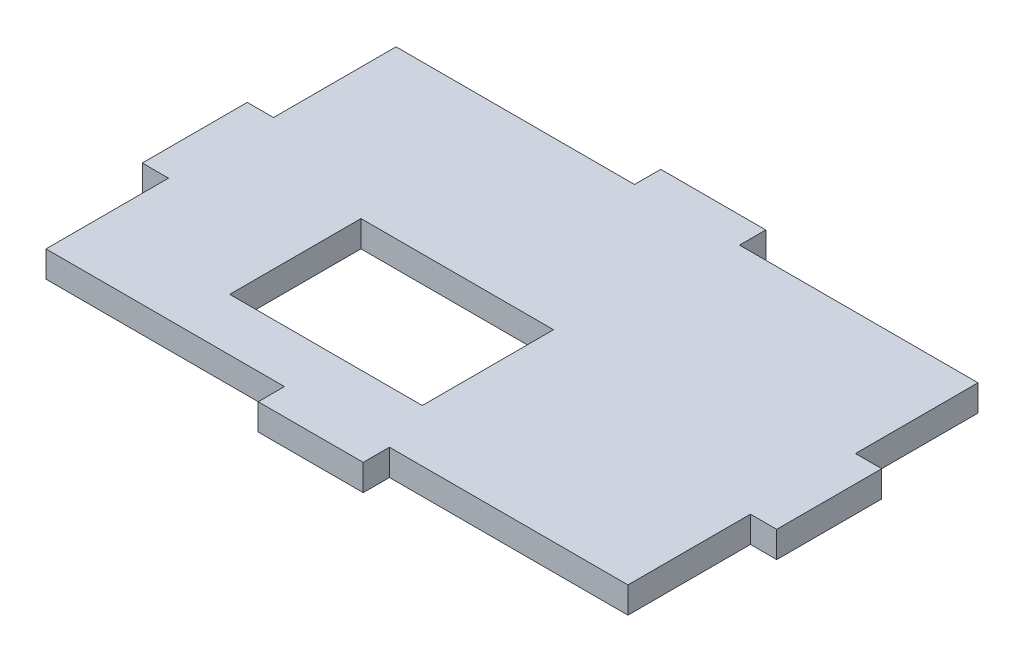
ISO-10303-21;
HEADER;
FILE_DESCRIPTION(('STEP AP214'),'2;1');
FILE_NAME('part.step','',(''),(''),'','','');
FILE_SCHEMA(('AUTOMOTIVE_DESIGN { 1 0 10303 214 1 1 1 1 }'));
ENDSEC;
DATA;
#1=APPLICATION_CONTEXT('core data for automotive mechanical design processes');
#2=APPLICATION_PROTOCOL_DEFINITION('international standard','automotive_design',2000,#1);
#3=PRODUCT_CONTEXT('',#1,'mechanical');
#4=PRODUCT('Part','Part','',(#3));
#5=PRODUCT_RELATED_PRODUCT_CATEGORY('part','',(#4));
#6=PRODUCT_DEFINITION_FORMATION('','',#4);
#7=PRODUCT_DEFINITION_CONTEXT('part definition',#1,'design');
#8=PRODUCT_DEFINITION('design','',#6,#7);
#9=PRODUCT_DEFINITION_SHAPE('','',#8);
#10=(LENGTH_UNIT() NAMED_UNIT(*) SI_UNIT(.MILLI.,.METRE.));
#11=(NAMED_UNIT(*) PLANE_ANGLE_UNIT() SI_UNIT($,.RADIAN.));
#12=(NAMED_UNIT(*) SI_UNIT($,.STERADIAN.) SOLID_ANGLE_UNIT());
#13=UNCERTAINTY_MEASURE_WITH_UNIT(LENGTH_MEASURE(1.E-05),#10,'distance_accuracy_value','');
#14=(GEOMETRIC_REPRESENTATION_CONTEXT(3) GLOBAL_UNCERTAINTY_ASSIGNED_CONTEXT((#13)) GLOBAL_UNIT_ASSIGNED_CONTEXT((#10,
#11,#12)) REPRESENTATION_CONTEXT('',''));
#15=CARTESIAN_POINT('',(0.,0.,0.));
#16=DIRECTION('',(0.,0.,1.));
#17=DIRECTION('',(1.,0.,0.));
#18=AXIS2_PLACEMENT_3D('',#15,#16,#17);
#19=CARTESIAN_POINT('',(66.5,3.,0.));
#20=DIRECTION('',(1.,0.,0.));
#21=DIRECTION('',(0.,0.,-1.));
#22=AXIS2_PLACEMENT_3D('',#19,#20,#21);
#23=PLANE('',#22);
#24=DIRECTION('',(0.,0.,1.));
#25=VECTOR('',#24,1.);
#26=CARTESIAN_POINT('',(66.5,0.,0.));
#27=LINE('',#26,#25);
#28=CARTESIAN_POINT('',(66.5,0.,0.));
#29=VERTEX_POINT('',#28);
#30=CARTESIAN_POINT('',(66.5,0.,14.));
#31=VERTEX_POINT('',#30);
#32=EDGE_CURVE('E242',#29,#31,#27,.T.);
#33=ORIENTED_EDGE('',*,*,#32,.F.);
#34=DIRECTION('',(0.,-1.,0.));
#35=VECTOR('',#34,1.);
#36=CARTESIAN_POINT('',(66.5,3.,0.));
#37=LINE('',#36,#35);
#38=CARTESIAN_POINT('',(66.5,3.,0.));
#39=VERTEX_POINT('',#38);
#40=EDGE_CURVE('E12',#39,#29,#37,.T.);
#41=ORIENTED_EDGE('',*,*,#40,.F.);
#42=DIRECTION('',(0.,0.,1.));
#43=VECTOR('',#42,1.);
#44=CARTESIAN_POINT('',(66.5,3.,0.));
#45=LINE('',#44,#43);
#46=CARTESIAN_POINT('',(66.5,3.,14.));
#47=VERTEX_POINT('',#46);
#48=EDGE_CURVE('E246',#39,#47,#45,.T.);
#49=ORIENTED_EDGE('',*,*,#48,.T.);
#50=DIRECTION('',(0.,-1.,0.));
#51=VECTOR('',#50,1.);
#52=CARTESIAN_POINT('',(66.5,3.,14.));
#53=LINE('',#52,#51);
#54=EDGE_CURVE('E282',#47,#31,#53,.T.);
#55=ORIENTED_EDGE('',*,*,#54,.T.);
#56=EDGE_LOOP('',(#33,#41,#49,#55));
#57=FACE_BOUND('',#56,.T.);
#58=ADVANCED_FACE('F40',(#57),#23,.T.);
#59=CARTESIAN_POINT('',(0.,3.,0.));
#60=DIRECTION('',(0.,0.,-1.));
#61=DIRECTION('',(-1.,0.,0.));
#62=AXIS2_PLACEMENT_3D('',#59,#60,#61);
#63=PLANE('',#62);
#64=DIRECTION('',(1.,0.,0.));
#65=VECTOR('',#64,1.);
#66=CARTESIAN_POINT('',(0.,0.,0.));
#67=LINE('',#66,#65);
#68=CARTESIAN_POINT('',(39.25,0.,0.));
#69=VERTEX_POINT('',#68);
#70=EDGE_CURVE('E285',#69,#29,#67,.T.);
#71=ORIENTED_EDGE('',*,*,#70,.F.);
#72=DIRECTION('',(0.,-1.,0.));
#73=VECTOR('',#72,1.);
#74=CARTESIAN_POINT('',(39.25,3.,0.));
#75=LINE('',#74,#73);
#76=CARTESIAN_POINT('',(39.25,3.,0.));
#77=VERTEX_POINT('',#76);
#78=EDGE_CURVE('E48',#77,#69,#75,.T.);
#79=ORIENTED_EDGE('',*,*,#78,.F.);
#80=DIRECTION('',(1.,0.,0.));
#81=VECTOR('',#80,1.);
#82=CARTESIAN_POINT('',(0.,3.,0.));
#83=LINE('',#82,#81);
#84=EDGE_CURVE('E251',#77,#39,#83,.T.);
#85=ORIENTED_EDGE('',*,*,#84,.T.);
#86=ORIENTED_EDGE('',*,*,#40,.T.);
#87=EDGE_LOOP('',(#71,#79,#85,#86));
#88=FACE_BOUND('',#87,.T.);
#89=ADVANCED_FACE('F378',(#88),#63,.T.);
#90=CARTESIAN_POINT('',(39.25,3.,0.));
#91=DIRECTION('',(-1.,0.,0.));
#92=DIRECTION('',(0.,0.,1.));
#93=AXIS2_PLACEMENT_3D('',#90,#91,#92);
#94=PLANE('',#93);
#95=DIRECTION('',(0.,0.,-1.));
#96=VECTOR('',#95,1.);
#97=CARTESIAN_POINT('',(39.25,0.,0.));
#98=LINE('',#97,#96);
#99=CARTESIAN_POINT('',(39.25,0.,-3.));
#100=VERTEX_POINT('',#99);
#101=EDGE_CURVE('E289',#69,#100,#98,.T.);
#102=ORIENTED_EDGE('',*,*,#101,.T.);
#103=DIRECTION('',(0.,-1.,0.));
#104=VECTOR('',#103,1.);
#105=CARTESIAN_POINT('',(39.25,3.,-3.));
#106=LINE('',#105,#104);
#107=CARTESIAN_POINT('',(39.25,3.,-3.));
#108=VERTEX_POINT('',#107);
#109=EDGE_CURVE('E367',#108,#100,#106,.T.);
#110=ORIENTED_EDGE('',*,*,#109,.F.);
#111=DIRECTION('',(0.,0.,-1.));
#112=VECTOR('',#111,1.);
#113=CARTESIAN_POINT('',(39.25,3.,0.));
#114=LINE('',#113,#112);
#115=EDGE_CURVE('E372',#77,#108,#114,.T.);
#116=ORIENTED_EDGE('',*,*,#115,.F.);
#117=ORIENTED_EDGE('',*,*,#78,.T.);
#118=EDGE_LOOP('',(#102,#110,#116,#117));
#119=FACE_BOUND('',#118,.T.);
#120=ADVANCED_FACE('F42',(#119),#94,.F.);
#121=CARTESIAN_POINT('',(0.,3.,-3.));
#122=DIRECTION('',(0.,0.,-1.));
#123=DIRECTION('',(-1.,0.,0.));
#124=AXIS2_PLACEMENT_3D('',#121,#122,#123);
#125=PLANE('',#124);
#126=DIRECTION('',(1.,0.,0.));
#127=VECTOR('',#126,1.);
#128=CARTESIAN_POINT('',(0.,0.,-3.));
#129=LINE('',#128,#127);
#130=CARTESIAN_POINT('',(27.25,0.,-3.));
#131=VERTEX_POINT('',#130);
#132=EDGE_CURVE('E293',#131,#100,#129,.T.);
#133=ORIENTED_EDGE('',*,*,#132,.F.);
#134=DIRECTION('',(0.,-1.,0.));
#135=VECTOR('',#134,1.);
#136=CARTESIAN_POINT('',(27.25,3.,-3.));
#137=LINE('',#136,#135);
#138=CARTESIAN_POINT('',(27.25,3.,-3.));
#139=VERTEX_POINT('',#138);
#140=EDGE_CURVE('E365',#139,#131,#137,.T.);
#141=ORIENTED_EDGE('',*,*,#140,.F.);
#142=DIRECTION('',(1.,0.,0.));
#143=VECTOR('',#142,1.);
#144=CARTESIAN_POINT('',(0.,3.,-3.));
#145=LINE('',#144,#143);
#146=EDGE_CURVE('E473',#139,#108,#145,.T.);
#147=ORIENTED_EDGE('',*,*,#146,.T.);
#148=ORIENTED_EDGE('',*,*,#109,.T.);
#149=EDGE_LOOP('',(#133,#141,#147,#148));
#150=FACE_BOUND('',#149,.T.);
#151=ADVANCED_FACE('F472',(#150),#125,.T.);
#152=CARTESIAN_POINT('',(27.25,3.,0.));
#153=DIRECTION('',(-1.,0.,0.));
#154=DIRECTION('',(0.,0.,1.));
#155=AXIS2_PLACEMENT_3D('',#152,#153,#154);
#156=PLANE('',#155);
#157=DIRECTION('',(0.,0.,-1.));
#158=VECTOR('',#157,1.);
#159=CARTESIAN_POINT('',(27.25,0.,0.));
#160=LINE('',#159,#158);
#161=CARTESIAN_POINT('',(27.25,0.,0.));
#162=VERTEX_POINT('',#161);
#163=EDGE_CURVE('E296',#162,#131,#160,.T.);
#164=ORIENTED_EDGE('',*,*,#163,.F.);
#165=DIRECTION('',(0.,-1.,0.));
#166=VECTOR('',#165,1.);
#167=CARTESIAN_POINT('',(27.25,3.,0.));
#168=LINE('',#167,#166);
#169=CARTESIAN_POINT('',(27.25,3.,0.));
#170=VERTEX_POINT('',#169);
#171=EDGE_CURVE('E363',#170,#162,#168,.T.);
#172=ORIENTED_EDGE('',*,*,#171,.F.);
#173=DIRECTION('',(0.,0.,-1.));
#174=VECTOR('',#173,1.);
#175=CARTESIAN_POINT('',(27.25,3.,0.));
#176=LINE('',#175,#174);
#177=EDGE_CURVE('E468',#170,#139,#176,.T.);
#178=ORIENTED_EDGE('',*,*,#177,.T.);
#179=ORIENTED_EDGE('',*,*,#140,.T.);
#180=EDGE_LOOP('',(#164,#172,#178,#179));
#181=FACE_BOUND('',#180,.T.);
#182=ADVANCED_FACE('F465',(#181),#156,.T.);
#183=CARTESIAN_POINT('',(0.,0.,0.));
#184=VERTEX_POINT('',#183);
#185=EDGE_CURVE('E290',#184,#162,#67,.T.);
#186=ORIENTED_EDGE('',*,*,#185,.F.);
#187=DIRECTION('',(0.,-1.,0.));
#188=VECTOR('',#187,1.);
#189=CARTESIAN_POINT('',(0.,3.,0.));
#190=LINE('',#189,#188);
#191=CARTESIAN_POINT('',(0.,3.,0.));
#192=VERTEX_POINT('',#191);
#193=EDGE_CURVE('E361',#192,#184,#190,.T.);
#194=ORIENTED_EDGE('',*,*,#193,.F.);
#195=EDGE_CURVE('E462',#192,#170,#83,.T.);
#196=ORIENTED_EDGE('',*,*,#195,.T.);
#197=ORIENTED_EDGE('',*,*,#171,.T.);
#198=EDGE_LOOP('',(#186,#194,#196,#197));
#199=FACE_BOUND('',#198,.T.);
#200=ADVANCED_FACE('F461',(#199),#63,.T.);
#201=CARTESIAN_POINT('',(0.,3.,0.));
#202=DIRECTION('',(1.,0.,0.));
#203=DIRECTION('',(0.,0.,-1.));
#204=AXIS2_PLACEMENT_3D('',#201,#202,#203);
#205=PLANE('',#204);
#206=DIRECTION('',(0.,0.,1.));
#207=VECTOR('',#206,1.);
#208=CARTESIAN_POINT('',(0.,0.,0.));
#209=LINE('',#208,#207);
#210=CARTESIAN_POINT('',(0.,0.,14.));
#211=VERTEX_POINT('',#210);
#212=EDGE_CURVE('E299',#184,#211,#209,.T.);
#213=ORIENTED_EDGE('',*,*,#212,.T.);
#214=DIRECTION('',(0.,-1.,0.));
#215=VECTOR('',#214,1.);
#216=CARTESIAN_POINT('',(0.,3.,14.));
#217=LINE('',#216,#215);
#218=CARTESIAN_POINT('',(0.,3.,14.));
#219=VERTEX_POINT('',#218);
#220=EDGE_CURVE('E358',#219,#211,#217,.T.);
#221=ORIENTED_EDGE('',*,*,#220,.F.);
#222=DIRECTION('',(0.,0.,1.));
#223=VECTOR('',#222,1.);
#224=CARTESIAN_POINT('',(0.,3.,0.));
#225=LINE('',#224,#223);
#226=EDGE_CURVE('E457',#192,#219,#225,.T.);
#227=ORIENTED_EDGE('',*,*,#226,.F.);
#228=ORIENTED_EDGE('',*,*,#193,.T.);
#229=EDGE_LOOP('',(#213,#221,#227,#228));
#230=FACE_BOUND('',#229,.T.);
#231=ADVANCED_FACE('F456',(#230),#205,.F.);
#232=CARTESIAN_POINT('',(0.,3.,14.));
#233=DIRECTION('',(0.,0.,1.));
#234=DIRECTION('',(1.,0.,0.));
#235=AXIS2_PLACEMENT_3D('',#232,#233,#234);
#236=PLANE('',#235);
#237=DIRECTION('',(-1.,0.,0.));
#238=VECTOR('',#237,1.);
#239=CARTESIAN_POINT('',(0.,0.,14.));
#240=LINE('',#239,#238);
#241=CARTESIAN_POINT('',(-3.,0.,14.));
#242=VERTEX_POINT('',#241);
#243=EDGE_CURVE('E301',#211,#242,#240,.T.);
#244=ORIENTED_EDGE('',*,*,#243,.T.);
#245=DIRECTION('',(0.,-1.,0.));
#246=VECTOR('',#245,1.);
#247=CARTESIAN_POINT('',(-3.,3.,14.));
#248=LINE('',#247,#246);
#249=CARTESIAN_POINT('',(-3.,3.,14.));
#250=VERTEX_POINT('',#249);
#251=EDGE_CURVE('E355',#250,#242,#248,.T.);
#252=ORIENTED_EDGE('',*,*,#251,.F.);
#253=DIRECTION('',(-1.,0.,0.));
#254=VECTOR('',#253,1.);
#255=CARTESIAN_POINT('',(0.,3.,14.));
#256=LINE('',#255,#254);
#257=EDGE_CURVE('E453',#219,#250,#256,.T.);
#258=ORIENTED_EDGE('',*,*,#257,.F.);
#259=ORIENTED_EDGE('',*,*,#220,.T.);
#260=EDGE_LOOP('',(#244,#252,#258,#259));
#261=FACE_BOUND('',#260,.T.);
#262=ADVANCED_FACE('F450',(#261),#236,.F.);
#263=CARTESIAN_POINT('',(-3.,3.,0.));
#264=DIRECTION('',(1.,0.,0.));
#265=DIRECTION('',(0.,0.,-1.));
#266=AXIS2_PLACEMENT_3D('',#263,#264,#265);
#267=PLANE('',#266);
#268=DIRECTION('',(0.,0.,1.));
#269=VECTOR('',#268,1.);
#270=CARTESIAN_POINT('',(-3.,0.,0.));
#271=LINE('',#270,#269);
#272=CARTESIAN_POINT('',(-3.,0.,26.));
#273=VERTEX_POINT('',#272);
#274=EDGE_CURVE('E304',#242,#273,#271,.T.);
#275=ORIENTED_EDGE('',*,*,#274,.T.);
#276=DIRECTION('',(0.,-1.,0.));
#277=VECTOR('',#276,1.);
#278=CARTESIAN_POINT('',(-3.,3.,26.));
#279=LINE('',#278,#277);
#280=CARTESIAN_POINT('',(-3.,3.,26.));
#281=VERTEX_POINT('',#280);
#282=EDGE_CURVE('E353',#281,#273,#279,.T.);
#283=ORIENTED_EDGE('',*,*,#282,.F.);
#284=DIRECTION('',(0.,0.,1.));
#285=VECTOR('',#284,1.);
#286=CARTESIAN_POINT('',(-3.,3.,0.));
#287=LINE('',#286,#285);
#288=EDGE_CURVE('E770',#250,#281,#287,.T.);
#289=ORIENTED_EDGE('',*,*,#288,.F.);
#290=ORIENTED_EDGE('',*,*,#251,.T.);
#291=EDGE_LOOP('',(#275,#283,#289,#290));
#292=FACE_BOUND('',#291,.T.);
#293=ADVANCED_FACE('F443',(#292),#267,.F.);
#294=CARTESIAN_POINT('',(0.,3.,26.));
#295=DIRECTION('',(0.,0.,1.));
#296=DIRECTION('',(1.,0.,0.));
#297=AXIS2_PLACEMENT_3D('',#294,#295,#296);
#298=PLANE('',#297);
#299=DIRECTION('',(-1.,0.,0.));
#300=VECTOR('',#299,1.);
#301=CARTESIAN_POINT('',(0.,0.,26.));
#302=LINE('',#301,#300);
#303=CARTESIAN_POINT('',(0.,0.,26.));
#304=VERTEX_POINT('',#303);
#305=EDGE_CURVE('E307',#304,#273,#302,.T.);
#306=ORIENTED_EDGE('',*,*,#305,.F.);
#307=DIRECTION('',(0.,-1.,0.));
#308=VECTOR('',#307,1.);
#309=CARTESIAN_POINT('',(0.,3.,26.));
#310=LINE('',#309,#308);
#311=CARTESIAN_POINT('',(0.,3.,26.));
#312=VERTEX_POINT('',#311);
#313=EDGE_CURVE('E351',#312,#304,#310,.T.);
#314=ORIENTED_EDGE('',*,*,#313,.F.);
#315=DIRECTION('',(-1.,0.,0.));
#316=VECTOR('',#315,1.);
#317=CARTESIAN_POINT('',(0.,3.,26.));
#318=LINE('',#317,#316);
#319=EDGE_CURVE('E440',#312,#281,#318,.T.);
#320=ORIENTED_EDGE('',*,*,#319,.T.);
#321=ORIENTED_EDGE('',*,*,#282,.T.);
#322=EDGE_LOOP('',(#306,#314,#320,#321));
#323=FACE_BOUND('',#322,.T.);
#324=ADVANCED_FACE('F437',(#323),#298,.T.);
#325=CARTESIAN_POINT('',(0.,0.,40.));
#326=VERTEX_POINT('',#325);
#327=EDGE_CURVE('E302',#304,#326,#209,.T.);
#328=ORIENTED_EDGE('',*,*,#327,.T.);
#329=DIRECTION('',(0.,-1.,0.));
#330=VECTOR('',#329,1.);
#331=CARTESIAN_POINT('',(0.,3.,40.));
#332=LINE('',#331,#330);
#333=CARTESIAN_POINT('',(0.,3.,40.));
#334=VERTEX_POINT('',#333);
#335=EDGE_CURVE('E348',#334,#326,#332,.T.);
#336=ORIENTED_EDGE('',*,*,#335,.F.);
#337=EDGE_CURVE('E432',#312,#334,#225,.T.);
#338=ORIENTED_EDGE('',*,*,#337,.F.);
#339=ORIENTED_EDGE('',*,*,#313,.T.);
#340=EDGE_LOOP('',(#328,#336,#338,#339));
#341=FACE_BOUND('',#340,.T.);
#342=ADVANCED_FACE('F431',(#341),#205,.F.);
#343=CARTESIAN_POINT('',(0.,3.,40.));
#344=DIRECTION('',(0.,0.,-1.));
#345=DIRECTION('',(-1.,0.,0.));
#346=AXIS2_PLACEMENT_3D('',#343,#344,#345);
#347=PLANE('',#346);
#348=DIRECTION('',(1.,0.,0.));
#349=VECTOR('',#348,1.);
#350=CARTESIAN_POINT('',(0.,0.,40.));
#351=LINE('',#350,#349);
#352=CARTESIAN_POINT('',(27.25,0.,40.));
#353=VERTEX_POINT('',#352);
#354=EDGE_CURVE('E310',#326,#353,#351,.T.);
#355=ORIENTED_EDGE('',*,*,#354,.T.);
#356=DIRECTION('',(0.,-1.,0.));
#357=VECTOR('',#356,1.);
#358=CARTESIAN_POINT('',(27.25,3.,40.));
#359=LINE('',#358,#357);
#360=CARTESIAN_POINT('',(27.25,3.,40.));
#361=VERTEX_POINT('',#360);
#362=EDGE_CURVE('E345',#361,#353,#359,.T.);
#363=ORIENTED_EDGE('',*,*,#362,.F.);
#364=DIRECTION('',(1.,0.,0.));
#365=VECTOR('',#364,1.);
#366=CARTESIAN_POINT('',(0.,3.,40.));
#367=LINE('',#366,#365);
#368=EDGE_CURVE('E427',#334,#361,#367,.T.);
#369=ORIENTED_EDGE('',*,*,#368,.F.);
#370=ORIENTED_EDGE('',*,*,#335,.T.);
#371=EDGE_LOOP('',(#355,#363,#369,#370));
#372=FACE_BOUND('',#371,.T.);
#373=ADVANCED_FACE('F426',(#372),#347,.F.);
#374=CARTESIAN_POINT('',(27.25,3.,0.));
#375=DIRECTION('',(1.,0.,0.));
#376=DIRECTION('',(0.,0.,-1.));
#377=AXIS2_PLACEMENT_3D('',#374,#375,#376);
#378=PLANE('',#377);
#379=DIRECTION('',(0.,0.,1.));
#380=VECTOR('',#379,1.);
#381=CARTESIAN_POINT('',(27.25,0.,0.));
#382=LINE('',#381,#380);
#383=CARTESIAN_POINT('',(27.25,0.,43.));
#384=VERTEX_POINT('',#383);
#385=EDGE_CURVE('E312',#353,#384,#382,.T.);
#386=ORIENTED_EDGE('',*,*,#385,.T.);
#387=DIRECTION('',(0.,-1.,0.));
#388=VECTOR('',#387,1.);
#389=CARTESIAN_POINT('',(27.25,3.,43.));
#390=LINE('',#389,#388);
#391=CARTESIAN_POINT('',(27.25,3.,43.));
#392=VERTEX_POINT('',#391);
#393=EDGE_CURVE('E342',#392,#384,#390,.T.);
#394=ORIENTED_EDGE('',*,*,#393,.F.);
#395=DIRECTION('',(0.,0.,1.));
#396=VECTOR('',#395,1.);
#397=CARTESIAN_POINT('',(27.25,3.,0.));
#398=LINE('',#397,#396);
#399=EDGE_CURVE('E423',#361,#392,#398,.T.);
#400=ORIENTED_EDGE('',*,*,#399,.F.);
#401=ORIENTED_EDGE('',*,*,#362,.T.);
#402=EDGE_LOOP('',(#386,#394,#400,#401));
#403=FACE_BOUND('',#402,.T.);
#404=ADVANCED_FACE('F420',(#403),#378,.F.);
#405=CARTESIAN_POINT('',(0.,3.,43.));
#406=DIRECTION('',(0.,0.,-1.));
#407=DIRECTION('',(-1.,0.,0.));
#408=AXIS2_PLACEMENT_3D('',#405,#406,#407);
#409=PLANE('',#408);
#410=DIRECTION('',(1.,0.,0.));
#411=VECTOR('',#410,1.);
#412=CARTESIAN_POINT('',(0.,0.,43.));
#413=LINE('',#412,#411);
#414=CARTESIAN_POINT('',(39.25,0.,43.));
#415=VERTEX_POINT('',#414);
#416=EDGE_CURVE('E315',#384,#415,#413,.T.);
#417=ORIENTED_EDGE('',*,*,#416,.T.);
#418=DIRECTION('',(0.,-1.,0.));
#419=VECTOR('',#418,1.);
#420=CARTESIAN_POINT('',(39.25,3.,43.));
#421=LINE('',#420,#419);
#422=CARTESIAN_POINT('',(39.25,3.,43.));
#423=VERTEX_POINT('',#422);
#424=EDGE_CURVE('E340',#423,#415,#421,.T.);
#425=ORIENTED_EDGE('',*,*,#424,.F.);
#426=DIRECTION('',(1.,0.,0.));
#427=VECTOR('',#426,1.);
#428=CARTESIAN_POINT('',(0.,3.,43.));
#429=LINE('',#428,#427);
#430=EDGE_CURVE('E511',#392,#423,#429,.T.);
#431=ORIENTED_EDGE('',*,*,#430,.F.);
#432=ORIENTED_EDGE('',*,*,#393,.T.);
#433=EDGE_LOOP('',(#417,#425,#431,#432));
#434=FACE_BOUND('',#433,.T.);
#435=ADVANCED_FACE('F414',(#434),#409,.F.);
#436=CARTESIAN_POINT('',(39.25,3.,0.));
#437=DIRECTION('',(1.,0.,0.));
#438=DIRECTION('',(0.,0.,-1.));
#439=AXIS2_PLACEMENT_3D('',#436,#437,#438);
#440=PLANE('',#439);
#441=DIRECTION('',(0.,0.,1.));
#442=VECTOR('',#441,1.);
#443=CARTESIAN_POINT('',(39.25,0.,0.));
#444=LINE('',#443,#442);
#445=CARTESIAN_POINT('',(39.25,0.,40.));
#446=VERTEX_POINT('',#445);
#447=EDGE_CURVE('E318',#446,#415,#444,.T.);
#448=ORIENTED_EDGE('',*,*,#447,.F.);
#449=DIRECTION('',(0.,-1.,0.));
#450=VECTOR('',#449,1.);
#451=CARTESIAN_POINT('',(39.25,3.,40.));
#452=LINE('',#451,#450);
#453=CARTESIAN_POINT('',(39.25,3.,40.));
#454=VERTEX_POINT('',#453);
#455=EDGE_CURVE('E338',#454,#446,#452,.T.);
#456=ORIENTED_EDGE('',*,*,#455,.F.);
#457=DIRECTION('',(0.,0.,1.));
#458=VECTOR('',#457,1.);
#459=CARTESIAN_POINT('',(39.25,3.,0.));
#460=LINE('',#459,#458);
#461=EDGE_CURVE('E271',#454,#423,#460,.T.);
#462=ORIENTED_EDGE('',*,*,#461,.T.);
#463=ORIENTED_EDGE('',*,*,#424,.T.);
#464=EDGE_LOOP('',(#448,#456,#462,#463));
#465=FACE_BOUND('',#464,.T.);
#466=ADVANCED_FACE('F408',(#465),#440,.T.);
#467=CARTESIAN_POINT('',(66.5,0.,40.));
#468=VERTEX_POINT('',#467);
#469=EDGE_CURVE('E313',#446,#468,#351,.T.);
#470=ORIENTED_EDGE('',*,*,#469,.T.);
#471=DIRECTION('',(0.,-1.,0.));
#472=VECTOR('',#471,1.);
#473=CARTESIAN_POINT('',(66.5,3.,40.));
#474=LINE('',#473,#472);
#475=CARTESIAN_POINT('',(66.5,3.,40.));
#476=VERTEX_POINT('',#475);
#477=EDGE_CURVE('E336',#476,#468,#474,.T.);
#478=ORIENTED_EDGE('',*,*,#477,.F.);
#479=EDGE_CURVE('E506',#454,#476,#367,.T.);
#480=ORIENTED_EDGE('',*,*,#479,.F.);
#481=ORIENTED_EDGE('',*,*,#455,.T.);
#482=EDGE_LOOP('',(#470,#478,#480,#481));
#483=FACE_BOUND('',#482,.T.);
#484=ADVANCED_FACE('F403',(#483),#347,.F.);
#485=CARTESIAN_POINT('',(66.5,0.,26.));
#486=VERTEX_POINT('',#485);
#487=EDGE_CURVE('E286',#486,#468,#27,.T.);
#488=ORIENTED_EDGE('',*,*,#487,.F.);
#489=DIRECTION('',(0.,-1.,0.));
#490=VECTOR('',#489,1.);
#491=CARTESIAN_POINT('',(66.5,3.,26.));
#492=LINE('',#491,#490);
#493=CARTESIAN_POINT('',(66.5,3.,26.));
#494=VERTEX_POINT('',#493);
#495=EDGE_CURVE('E334',#494,#486,#492,.T.);
#496=ORIENTED_EDGE('',*,*,#495,.F.);
#497=EDGE_CURVE('E253',#494,#476,#45,.T.);
#498=ORIENTED_EDGE('',*,*,#497,.T.);
#499=ORIENTED_EDGE('',*,*,#477,.T.);
#500=EDGE_LOOP('',(#488,#496,#498,#499));
#501=FACE_BOUND('',#500,.T.);
#502=ADVANCED_FACE('F397',(#501),#23,.T.);
#503=CARTESIAN_POINT('',(0.,3.,26.));
#504=DIRECTION('',(0.,0.,-1.));
#505=DIRECTION('',(-1.,0.,0.));
#506=AXIS2_PLACEMENT_3D('',#503,#504,#505);
#507=PLANE('',#506);
#508=DIRECTION('',(1.,0.,0.));
#509=VECTOR('',#508,1.);
#510=CARTESIAN_POINT('',(0.,0.,26.));
#511=LINE('',#510,#509);
#512=CARTESIAN_POINT('',(69.5,0.,26.));
#513=VERTEX_POINT('',#512);
#514=EDGE_CURVE('E321',#486,#513,#511,.T.);
#515=ORIENTED_EDGE('',*,*,#514,.T.);
#516=DIRECTION('',(0.,-1.,0.));
#517=VECTOR('',#516,1.);
#518=CARTESIAN_POINT('',(69.5,3.,26.));
#519=LINE('',#518,#517);
#520=CARTESIAN_POINT('',(69.5,3.,26.));
#521=VERTEX_POINT('',#520);
#522=EDGE_CURVE('E332',#521,#513,#519,.T.);
#523=ORIENTED_EDGE('',*,*,#522,.F.);
#524=DIRECTION('',(1.,0.,0.));
#525=VECTOR('',#524,1.);
#526=CARTESIAN_POINT('',(0.,3.,26.));
#527=LINE('',#526,#525);
#528=EDGE_CURVE('E266',#494,#521,#527,.T.);
#529=ORIENTED_EDGE('',*,*,#528,.F.);
#530=ORIENTED_EDGE('',*,*,#495,.T.);
#531=EDGE_LOOP('',(#515,#523,#529,#530));
#532=FACE_BOUND('',#531,.T.);
#533=ADVANCED_FACE('F519',(#532),#507,.F.);
#534=CARTESIAN_POINT('',(69.5,3.,0.));
#535=DIRECTION('',(1.,0.,0.));
#536=DIRECTION('',(0.,0.,-1.));
#537=AXIS2_PLACEMENT_3D('',#534,#535,#536);
#538=PLANE('',#537);
#539=DIRECTION('',(0.,0.,1.));
#540=VECTOR('',#539,1.);
#541=CARTESIAN_POINT('',(69.5,0.,0.));
#542=LINE('',#541,#540);
#543=CARTESIAN_POINT('',(69.5,0.,14.));
#544=VERTEX_POINT('',#543);
#545=EDGE_CURVE('E324',#544,#513,#542,.T.);
#546=ORIENTED_EDGE('',*,*,#545,.F.);
#547=DIRECTION('',(0.,-1.,0.));
#548=VECTOR('',#547,1.);
#549=CARTESIAN_POINT('',(69.5,3.,14.));
#550=LINE('',#549,#548);
#551=CARTESIAN_POINT('',(69.5,3.,14.));
#552=VERTEX_POINT('',#551);
#553=EDGE_CURVE('E330',#552,#544,#550,.T.);
#554=ORIENTED_EDGE('',*,*,#553,.F.);
#555=DIRECTION('',(0.,0.,1.));
#556=VECTOR('',#555,1.);
#557=CARTESIAN_POINT('',(69.5,3.,0.));
#558=LINE('',#557,#556);
#559=EDGE_CURVE('E270',#552,#521,#558,.T.);
#560=ORIENTED_EDGE('',*,*,#559,.T.);
#561=ORIENTED_EDGE('',*,*,#522,.T.);
#562=EDGE_LOOP('',(#546,#554,#560,#561));
#563=FACE_BOUND('',#562,.T.);
#564=ADVANCED_FACE('F389',(#563),#538,.T.);
#565=CARTESIAN_POINT('',(0.,3.,14.));
#566=DIRECTION('',(0.,0.,-1.));
#567=DIRECTION('',(-1.,0.,0.));
#568=AXIS2_PLACEMENT_3D('',#565,#566,#567);
#569=PLANE('',#568);
#570=DIRECTION('',(1.,0.,0.));
#571=VECTOR('',#570,1.);
#572=CARTESIAN_POINT('',(0.,0.,14.));
#573=LINE('',#572,#571);
#574=EDGE_CURVE('E252',#31,#544,#573,.T.);
#575=ORIENTED_EDGE('',*,*,#574,.F.);
#576=ORIENTED_EDGE('',*,*,#54,.F.);
#577=DIRECTION('',(1.,0.,0.));
#578=VECTOR('',#577,1.);
#579=CARTESIAN_POINT('',(0.,3.,14.));
#580=LINE('',#579,#578);
#581=EDGE_CURVE('E277',#47,#552,#580,.T.);
#582=ORIENTED_EDGE('',*,*,#581,.T.);
#583=ORIENTED_EDGE('',*,*,#553,.T.);
#584=EDGE_LOOP('',(#575,#576,#582,#583));
#585=FACE_BOUND('',#584,.T.);
#586=ADVANCED_FACE('F384',(#585),#569,.T.);
#587=CARTESIAN_POINT('',(0.,3.,0.));
#588=DIRECTION('',(0.,1.,0.));
#589=DIRECTION('',(0.,0.,1.));
#590=AXIS2_PLACEMENT_3D('',#587,#588,#589);
#591=PLANE('',#590);
#592=DIRECTION('',(0.,0.,1.));
#593=VECTOR('',#592,1.);
#594=CARTESIAN_POINT('',(14.9959321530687,3.,19.));
#595=LINE('',#594,#593);
#596=CARTESIAN_POINT('',(14.9959321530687,3.,19.));
#597=VERTEX_POINT('',#596);
#598=CARTESIAN_POINT('',(14.9959321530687,3.,34.));
#599=VERTEX_POINT('',#598);
#600=EDGE_CURVE('E55',#597,#599,#595,.T.);
#601=ORIENTED_EDGE('',*,*,#600,.F.);
#602=DIRECTION('',(-1.,0.,0.));
#603=VECTOR('',#602,1.);
#604=CARTESIAN_POINT('',(14.9959321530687,3.,19.));
#605=LINE('',#604,#603);
#606=CARTESIAN_POINT('',(36.9959321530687,3.,19.));
#607=VERTEX_POINT('',#606);
#608=EDGE_CURVE('E218',#607,#597,#605,.T.);
#609=ORIENTED_EDGE('',*,*,#608,.F.);
#610=DIRECTION('',(0.,0.,-1.));
#611=VECTOR('',#610,1.);
#612=CARTESIAN_POINT('',(36.9959321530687,3.,19.));
#613=LINE('',#612,#611);
#614=CARTESIAN_POINT('',(36.9959321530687,3.,34.));
#615=VERTEX_POINT('',#614);
#616=EDGE_CURVE('E222',#615,#607,#613,.T.);
#617=ORIENTED_EDGE('',*,*,#616,.F.);
#618=DIRECTION('',(1.,0.,0.));
#619=VECTOR('',#618,1.);
#620=CARTESIAN_POINT('',(14.9959321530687,3.,34.));
#621=LINE('',#620,#619);
#622=EDGE_CURVE('E230',#599,#615,#621,.T.);
#623=ORIENTED_EDGE('',*,*,#622,.F.);
#624=EDGE_LOOP('',(#601,#609,#617,#623));
#625=FACE_BOUND('',#624,.T.);
#626=ORIENTED_EDGE('',*,*,#48,.F.);
#627=ORIENTED_EDGE('',*,*,#84,.F.);
#628=ORIENTED_EDGE('',*,*,#115,.T.);
#629=ORIENTED_EDGE('',*,*,#146,.F.);
#630=ORIENTED_EDGE('',*,*,#177,.F.);
#631=ORIENTED_EDGE('',*,*,#195,.F.);
#632=ORIENTED_EDGE('',*,*,#226,.T.);
#633=ORIENTED_EDGE('',*,*,#257,.T.);
#634=ORIENTED_EDGE('',*,*,#288,.T.);
#635=ORIENTED_EDGE('',*,*,#319,.F.);
#636=ORIENTED_EDGE('',*,*,#337,.T.);
#637=ORIENTED_EDGE('',*,*,#368,.T.);
#638=ORIENTED_EDGE('',*,*,#399,.T.);
#639=ORIENTED_EDGE('',*,*,#430,.T.);
#640=ORIENTED_EDGE('',*,*,#461,.F.);
#641=ORIENTED_EDGE('',*,*,#479,.T.);
#642=ORIENTED_EDGE('',*,*,#497,.F.);
#643=ORIENTED_EDGE('',*,*,#528,.T.);
#644=ORIENTED_EDGE('',*,*,#559,.F.);
#645=ORIENTED_EDGE('',*,*,#581,.F.);
#646=EDGE_LOOP('',(#626,#627,#628,#629,#630,#631,#632,#633,#634,#635,#636,#637,#638,#639,#640,
#641,#642,#643,#644,#645));
#647=FACE_BOUND('',#646,.T.);
#648=ADVANCED_FACE('F518',(#625,#647),#591,.T.);
#649=CARTESIAN_POINT('',(0.,0.,0.));
#650=DIRECTION('',(0.,1.,0.));
#651=DIRECTION('',(0.,0.,1.));
#652=AXIS2_PLACEMENT_3D('',#649,#650,#651);
#653=PLANE('',#652);
#654=DIRECTION('',(-1.,0.,0.));
#655=VECTOR('',#654,1.);
#656=CARTESIAN_POINT('',(14.9959321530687,0.,19.));
#657=LINE('',#656,#655);
#658=CARTESIAN_POINT('',(36.9959321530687,0.,19.));
#659=VERTEX_POINT('',#658);
#660=CARTESIAN_POINT('',(14.9959321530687,0.,19.));
#661=VERTEX_POINT('',#660);
#662=EDGE_CURVE('E208',#659,#661,#657,.T.);
#663=ORIENTED_EDGE('',*,*,#662,.T.);
#664=DIRECTION('',(0.,0.,1.));
#665=VECTOR('',#664,1.);
#666=CARTESIAN_POINT('',(14.9959321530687,0.,19.));
#667=LINE('',#666,#665);
#668=CARTESIAN_POINT('',(14.9959321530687,0.,34.));
#669=VERTEX_POINT('',#668);
#670=EDGE_CURVE('E202',#661,#669,#667,.T.);
#671=ORIENTED_EDGE('',*,*,#670,.T.);
#672=DIRECTION('',(1.,0.,0.));
#673=VECTOR('',#672,1.);
#674=CARTESIAN_POINT('',(14.9959321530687,0.,34.));
#675=LINE('',#674,#673);
#676=CARTESIAN_POINT('',(36.9959321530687,0.,34.));
#677=VERTEX_POINT('',#676);
#678=EDGE_CURVE('E211',#669,#677,#675,.T.);
#679=ORIENTED_EDGE('',*,*,#678,.T.);
#680=DIRECTION('',(0.,0.,-1.));
#681=VECTOR('',#680,1.);
#682=CARTESIAN_POINT('',(36.9959321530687,0.,19.));
#683=LINE('',#682,#681);
#684=EDGE_CURVE('E63',#677,#659,#683,.T.);
#685=ORIENTED_EDGE('',*,*,#684,.T.);
#686=EDGE_LOOP('',(#663,#671,#679,#685));
#687=FACE_BOUND('',#686,.T.);
#688=ORIENTED_EDGE('',*,*,#32,.T.);
#689=ORIENTED_EDGE('',*,*,#574,.T.);
#690=ORIENTED_EDGE('',*,*,#545,.T.);
#691=ORIENTED_EDGE('',*,*,#514,.F.);
#692=ORIENTED_EDGE('',*,*,#487,.T.);
#693=ORIENTED_EDGE('',*,*,#469,.F.);
#694=ORIENTED_EDGE('',*,*,#447,.T.);
#695=ORIENTED_EDGE('',*,*,#416,.F.);
#696=ORIENTED_EDGE('',*,*,#385,.F.);
#697=ORIENTED_EDGE('',*,*,#354,.F.);
#698=ORIENTED_EDGE('',*,*,#327,.F.);
#699=ORIENTED_EDGE('',*,*,#305,.T.);
#700=ORIENTED_EDGE('',*,*,#274,.F.);
#701=ORIENTED_EDGE('',*,*,#243,.F.);
#702=ORIENTED_EDGE('',*,*,#212,.F.);
#703=ORIENTED_EDGE('',*,*,#185,.T.);
#704=ORIENTED_EDGE('',*,*,#163,.T.);
#705=ORIENTED_EDGE('',*,*,#132,.T.);
#706=ORIENTED_EDGE('',*,*,#101,.F.);
#707=ORIENTED_EDGE('',*,*,#70,.T.);
#708=EDGE_LOOP('',(#688,#689,#690,#691,#692,#693,#694,#695,#696,#697,#698,#699,#700,#701,#702,
#703,#704,#705,#706,#707));
#709=FACE_BOUND('',#708,.T.);
#710=ADVANCED_FACE('F215',(#687,#709),#653,.F.);
#711=CARTESIAN_POINT('',(14.9959321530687,0.,19.));
#712=DIRECTION('',(-1.,0.,0.));
#713=DIRECTION('',(0.,0.,1.));
#714=AXIS2_PLACEMENT_3D('',#711,#712,#713);
#715=PLANE('',#714);
#716=ORIENTED_EDGE('',*,*,#600,.T.);
#717=DIRECTION('',(0.,1.,0.));
#718=VECTOR('',#717,1.);
#719=CARTESIAN_POINT('',(14.9959321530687,0.,34.));
#720=LINE('',#719,#718);
#721=EDGE_CURVE('E198',#669,#599,#720,.T.);
#722=ORIENTED_EDGE('',*,*,#721,.F.);
#723=ORIENTED_EDGE('',*,*,#670,.F.);
#724=DIRECTION('',(0.,1.,0.));
#725=VECTOR('',#724,1.);
#726=CARTESIAN_POINT('',(14.9959321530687,0.,19.));
#727=LINE('',#726,#725);
#728=EDGE_CURVE('E240',#661,#597,#727,.T.);
#729=ORIENTED_EDGE('',*,*,#728,.T.);
#730=EDGE_LOOP('',(#716,#722,#723,#729));
#731=FACE_BOUND('',#730,.T.);
#732=ADVANCED_FACE('F200',(#731),#715,.F.);
#733=CARTESIAN_POINT('',(14.9959321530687,0.,19.));
#734=DIRECTION('',(0.,0.,-1.));
#735=DIRECTION('',(-1.,0.,0.));
#736=AXIS2_PLACEMENT_3D('',#733,#734,#735);
#737=PLANE('',#736);
#738=ORIENTED_EDGE('',*,*,#608,.T.);
#739=ORIENTED_EDGE('',*,*,#728,.F.);
#740=ORIENTED_EDGE('',*,*,#662,.F.);
#741=DIRECTION('',(0.,1.,0.));
#742=VECTOR('',#741,1.);
#743=CARTESIAN_POINT('',(36.9959321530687,0.,19.));
#744=LINE('',#743,#742);
#745=EDGE_CURVE('E243',#659,#607,#744,.T.);
#746=ORIENTED_EDGE('',*,*,#745,.T.);
#747=EDGE_LOOP('',(#738,#739,#740,#746));
#748=FACE_BOUND('',#747,.T.);
#749=ADVANCED_FACE('F728',(#748),#737,.F.);
#750=CARTESIAN_POINT('',(36.9959321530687,0.,19.));
#751=DIRECTION('',(1.,0.,0.));
#752=DIRECTION('',(0.,0.,-1.));
#753=AXIS2_PLACEMENT_3D('',#750,#751,#752);
#754=PLANE('',#753);
#755=ORIENTED_EDGE('',*,*,#616,.T.);
#756=ORIENTED_EDGE('',*,*,#745,.F.);
#757=ORIENTED_EDGE('',*,*,#684,.F.);
#758=DIRECTION('',(0.,1.,0.));
#759=VECTOR('',#758,1.);
#760=CARTESIAN_POINT('',(36.9959321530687,0.,34.));
#761=LINE('',#760,#759);
#762=EDGE_CURVE('E207',#677,#615,#761,.T.);
#763=ORIENTED_EDGE('',*,*,#762,.T.);
#764=EDGE_LOOP('',(#755,#756,#757,#763));
#765=FACE_BOUND('',#764,.T.);
#766=ADVANCED_FACE('F736',(#765),#754,.F.);
#767=CARTESIAN_POINT('',(14.9959321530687,0.,34.));
#768=DIRECTION('',(0.,0.,1.));
#769=DIRECTION('',(1.,0.,0.));
#770=AXIS2_PLACEMENT_3D('',#767,#768,#769);
#771=PLANE('',#770);
#772=ORIENTED_EDGE('',*,*,#622,.T.);
#773=ORIENTED_EDGE('',*,*,#762,.F.);
#774=ORIENTED_EDGE('',*,*,#678,.F.);
#775=ORIENTED_EDGE('',*,*,#721,.T.);
#776=EDGE_LOOP('',(#772,#773,#774,#775));
#777=FACE_BOUND('',#776,.T.);
#778=ADVANCED_FACE('F212',(#777),#771,.F.);
#779=CLOSED_SHELL('',(#58,#89,#120,#151,#182,#200,#231,#262,#293,#324,#342,#373,#404,#435,#466,
#484,#502,#533,#564,#586,#648,#710,#732,#749,#766,#778));
#780=MANIFOLD_SOLID_BREP('B2',#779);
#781=ADVANCED_BREP_SHAPE_REPRESENTATION('',(#18,#780),#14);
#782=SHAPE_DEFINITION_REPRESENTATION(#9,#781);
ENDSEC;
END-ISO-10303-21;
